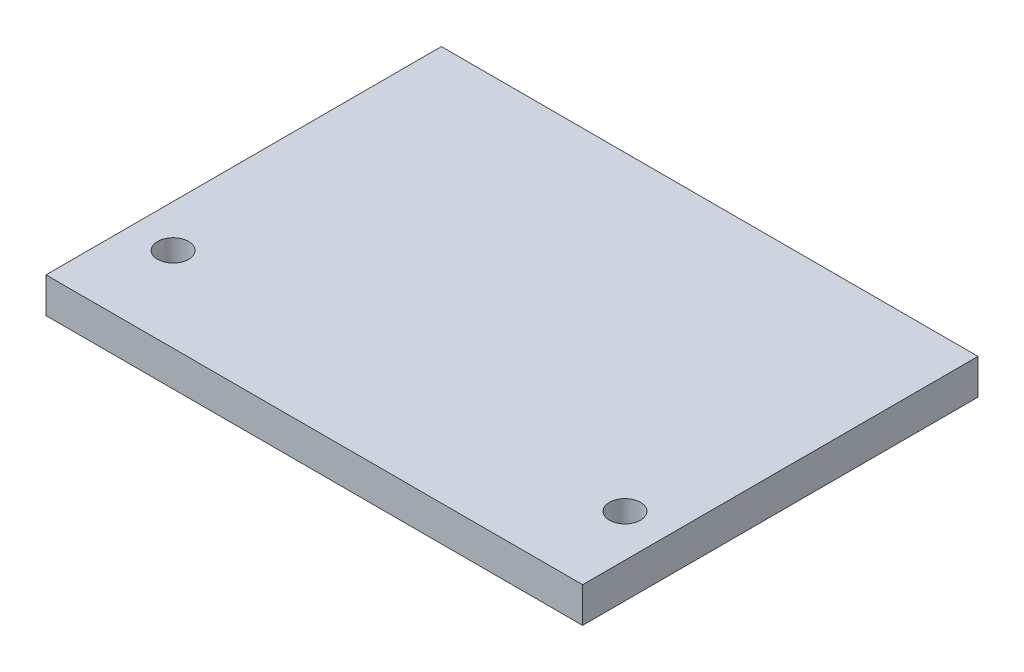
ISO-10303-21;
HEADER;
FILE_DESCRIPTION(('STEP AP214'),'2;1');
FILE_NAME('part.step','',(''),(''),'','','');
FILE_SCHEMA(('AUTOMOTIVE_DESIGN { 1 0 10303 214 1 1 1 1 }'));
ENDSEC;
DATA;
#1=APPLICATION_CONTEXT('core data for automotive mechanical design processes');
#2=APPLICATION_PROTOCOL_DEFINITION('international standard','automotive_design',2000,#1);
#3=PRODUCT_CONTEXT('',#1,'mechanical');
#4=PRODUCT('Part','Part','',(#3));
#5=PRODUCT_RELATED_PRODUCT_CATEGORY('part','',(#4));
#6=PRODUCT_DEFINITION_FORMATION('','',#4);
#7=PRODUCT_DEFINITION_CONTEXT('part definition',#1,'design');
#8=PRODUCT_DEFINITION('design','',#6,#7);
#9=PRODUCT_DEFINITION_SHAPE('','',#8);
#10=(LENGTH_UNIT() NAMED_UNIT(*) SI_UNIT(.MILLI.,.METRE.));
#11=(NAMED_UNIT(*) PLANE_ANGLE_UNIT() SI_UNIT($,.RADIAN.));
#12=(NAMED_UNIT(*) SI_UNIT($,.STERADIAN.) SOLID_ANGLE_UNIT());
#13=UNCERTAINTY_MEASURE_WITH_UNIT(LENGTH_MEASURE(1.E-05),#10,'distance_accuracy_value','');
#14=(GEOMETRIC_REPRESENTATION_CONTEXT(3) GLOBAL_UNCERTAINTY_ASSIGNED_CONTEXT((#13)) GLOBAL_UNIT_ASSIGNED_CONTEXT((#10,
#11,#12)) REPRESENTATION_CONTEXT('',''));
#15=CARTESIAN_POINT('',(0.,0.,0.));
#16=DIRECTION('',(0.,0.,1.));
#17=DIRECTION('',(1.,0.,0.));
#18=AXIS2_PLACEMENT_3D('',#15,#16,#17);
#19=CARTESIAN_POINT('',(0.,2.5,0.));
#20=DIRECTION('',(0.,-1.,0.));
#21=DIRECTION('',(0.,0.,-1.));
#22=AXIS2_PLACEMENT_3D('',#19,#20,#21);
#23=PLANE('',#22);
#24=CARTESIAN_POINT('',(35.,2.5,-6.));
#25=DIRECTION('',(0.,1.,0.));
#26=DIRECTION('',(0.,0.,1.));
#27=AXIS2_PLACEMENT_3D('',#24,#25,#26);
#28=CIRCLE('',#27,1.1);
#29=CARTESIAN_POINT('',(35.,2.5,-4.9));
#30=VERTEX_POINT('',#29);
#31=EDGE_CURVE('E85',#30,#30,#28,.T.);
#32=ORIENTED_EDGE('',*,*,#31,.F.);
#33=EDGE_LOOP('',(#32));
#34=FACE_BOUND('',#33,.T.);
#35=DIRECTION('',(0.,0.,1.));
#36=VECTOR('',#35,1.);
#37=CARTESIAN_POINT('',(0.,2.5,0.));
#38=LINE('',#37,#36);
#39=CARTESIAN_POINT('',(0.,2.5,-28.));
#40=VERTEX_POINT('',#39);
#41=CARTESIAN_POINT('',(0.,2.5,0.));
#42=VERTEX_POINT('',#41);
#43=EDGE_CURVE('E95',#40,#42,#38,.T.);
#44=ORIENTED_EDGE('',*,*,#43,.T.);
#45=DIRECTION('',(1.,0.,0.));
#46=VECTOR('',#45,1.);
#47=CARTESIAN_POINT('',(0.,2.5,0.));
#48=LINE('',#47,#46);
#49=CARTESIAN_POINT('',(38.,2.5,0.));
#50=VERTEX_POINT('',#49);
#51=EDGE_CURVE('E80',#42,#50,#48,.T.);
#52=ORIENTED_EDGE('',*,*,#51,.T.);
#53=DIRECTION('',(0.,0.,-1.));
#54=VECTOR('',#53,1.);
#55=CARTESIAN_POINT('',(38.,2.5,0.));
#56=LINE('',#55,#54);
#57=CARTESIAN_POINT('',(38.,2.5,-28.));
#58=VERTEX_POINT('',#57);
#59=EDGE_CURVE('E46',#50,#58,#56,.T.);
#60=ORIENTED_EDGE('',*,*,#59,.T.);
#61=DIRECTION('',(-1.,0.,0.));
#62=VECTOR('',#61,1.);
#63=CARTESIAN_POINT('',(0.,2.5,-28.));
#64=LINE('',#63,#62);
#65=EDGE_CURVE('E41',#58,#40,#64,.T.);
#66=ORIENTED_EDGE('',*,*,#65,.T.);
#67=EDGE_LOOP('',(#44,#52,#60,#66));
#68=FACE_BOUND('',#67,.T.);
#69=CARTESIAN_POINT('',(3.,2.5,-6.));
#70=DIRECTION('',(0.,1.,0.));
#71=DIRECTION('',(0.,0.,-1.));
#72=AXIS2_PLACEMENT_3D('',#69,#70,#71);
#73=CIRCLE('',#72,1.1);
#74=CARTESIAN_POINT('',(3.,2.5,-7.1));
#75=VERTEX_POINT('',#74);
#76=EDGE_CURVE('E113',#75,#75,#73,.T.);
#77=ORIENTED_EDGE('',*,*,#76,.F.);
#78=EDGE_LOOP('',(#77));
#79=FACE_BOUND('',#78,.T.);
#80=ADVANCED_FACE('F26',(#34,#68,#79),#23,.F.);
#81=CARTESIAN_POINT('',(0.,0.,0.));
#82=DIRECTION('',(0.,-1.,0.));
#83=DIRECTION('',(0.,0.,-1.));
#84=AXIS2_PLACEMENT_3D('',#81,#82,#83);
#85=PLANE('',#84);
#86=CARTESIAN_POINT('',(35.,0.,-6.));
#87=DIRECTION('',(0.,1.,0.));
#88=DIRECTION('',(0.,0.,1.));
#89=AXIS2_PLACEMENT_3D('',#86,#87,#88);
#90=CIRCLE('',#89,1.1);
#91=CARTESIAN_POINT('',(35.,0.,-4.9));
#92=VERTEX_POINT('',#91);
#93=EDGE_CURVE('E88',#92,#92,#90,.T.);
#94=ORIENTED_EDGE('',*,*,#93,.T.);
#95=EDGE_LOOP('',(#94));
#96=FACE_BOUND('',#95,.T.);
#97=DIRECTION('',(0.,0.,1.));
#98=VECTOR('',#97,1.);
#99=CARTESIAN_POINT('',(0.,0.,0.));
#100=LINE('',#99,#98);
#101=CARTESIAN_POINT('',(0.,0.,-28.));
#102=VERTEX_POINT('',#101);
#103=CARTESIAN_POINT('',(0.,0.,0.));
#104=VERTEX_POINT('',#103);
#105=EDGE_CURVE('E72',#102,#104,#100,.T.);
#106=ORIENTED_EDGE('',*,*,#105,.F.);
#107=DIRECTION('',(-1.,0.,0.));
#108=VECTOR('',#107,1.);
#109=CARTESIAN_POINT('',(0.,0.,-28.));
#110=LINE('',#109,#108);
#111=CARTESIAN_POINT('',(38.,0.,-28.));
#112=VERTEX_POINT('',#111);
#113=EDGE_CURVE('E93',#112,#102,#110,.T.);
#114=ORIENTED_EDGE('',*,*,#113,.F.);
#115=DIRECTION('',(0.,0.,-1.));
#116=VECTOR('',#115,1.);
#117=CARTESIAN_POINT('',(38.,0.,0.));
#118=LINE('',#117,#116);
#119=CARTESIAN_POINT('',(38.,0.,0.));
#120=VERTEX_POINT('',#119);
#121=EDGE_CURVE('E73',#120,#112,#118,.T.);
#122=ORIENTED_EDGE('',*,*,#121,.F.);
#123=DIRECTION('',(1.,0.,0.));
#124=VECTOR('',#123,1.);
#125=CARTESIAN_POINT('',(0.,0.,0.));
#126=LINE('',#125,#124);
#127=EDGE_CURVE('E67',#104,#120,#126,.T.);
#128=ORIENTED_EDGE('',*,*,#127,.F.);
#129=EDGE_LOOP('',(#106,#114,#122,#128));
#130=FACE_BOUND('',#129,.T.);
#131=CARTESIAN_POINT('',(3.,0.,-6.));
#132=DIRECTION('',(0.,1.,0.));
#133=DIRECTION('',(0.,0.,-1.));
#134=AXIS2_PLACEMENT_3D('',#131,#132,#133);
#135=CIRCLE('',#134,1.1);
#136=CARTESIAN_POINT('',(3.,0.,-7.1));
#137=VERTEX_POINT('',#136);
#138=EDGE_CURVE('E115',#137,#137,#135,.T.);
#139=ORIENTED_EDGE('',*,*,#138,.T.);
#140=EDGE_LOOP('',(#139));
#141=FACE_BOUND('',#140,.T.);
#142=ADVANCED_FACE('F68',(#96,#130,#141),#85,.T.);
#143=CARTESIAN_POINT('',(0.,2.5,0.));
#144=DIRECTION('',(1.,0.,0.));
#145=DIRECTION('',(0.,0.,-1.));
#146=AXIS2_PLACEMENT_3D('',#143,#144,#145);
#147=PLANE('',#146);
#148=ORIENTED_EDGE('',*,*,#105,.T.);
#149=DIRECTION('',(0.,-1.,0.));
#150=VECTOR('',#149,1.);
#151=CARTESIAN_POINT('',(0.,2.5,0.));
#152=LINE('',#151,#150);
#153=EDGE_CURVE('E11',#42,#104,#152,.T.);
#154=ORIENTED_EDGE('',*,*,#153,.F.);
#155=ORIENTED_EDGE('',*,*,#43,.F.);
#156=DIRECTION('',(0.,-1.,0.));
#157=VECTOR('',#156,1.);
#158=CARTESIAN_POINT('',(0.,2.5,-28.));
#159=LINE('',#158,#157);
#160=EDGE_CURVE('E84',#40,#102,#159,.T.);
#161=ORIENTED_EDGE('',*,*,#160,.T.);
#162=EDGE_LOOP('',(#148,#154,#155,#161));
#163=FACE_BOUND('',#162,.T.);
#164=ADVANCED_FACE('F28',(#163),#147,.F.);
#165=CARTESIAN_POINT('',(0.,2.5,0.));
#166=DIRECTION('',(0.,0.,-1.));
#167=DIRECTION('',(-1.,0.,0.));
#168=AXIS2_PLACEMENT_3D('',#165,#166,#167);
#169=PLANE('',#168);
#170=ORIENTED_EDGE('',*,*,#127,.T.);
#171=DIRECTION('',(0.,-1.,0.));
#172=VECTOR('',#171,1.);
#173=CARTESIAN_POINT('',(38.,2.5,0.));
#174=LINE('',#173,#172);
#175=EDGE_CURVE('E34',#50,#120,#174,.T.);
#176=ORIENTED_EDGE('',*,*,#175,.F.);
#177=ORIENTED_EDGE('',*,*,#51,.F.);
#178=ORIENTED_EDGE('',*,*,#153,.T.);
#179=EDGE_LOOP('',(#170,#176,#177,#178));
#180=FACE_BOUND('',#179,.T.);
#181=ADVANCED_FACE('F79',(#180),#169,.F.);
#182=CARTESIAN_POINT('',(38.,2.5,0.));
#183=DIRECTION('',(-1.,0.,0.));
#184=DIRECTION('',(0.,0.,1.));
#185=AXIS2_PLACEMENT_3D('',#182,#183,#184);
#186=PLANE('',#185);
#187=ORIENTED_EDGE('',*,*,#121,.T.);
#188=DIRECTION('',(0.,-1.,0.));
#189=VECTOR('',#188,1.);
#190=CARTESIAN_POINT('',(38.,2.5,-28.));
#191=LINE('',#190,#189);
#192=EDGE_CURVE('E101',#58,#112,#191,.T.);
#193=ORIENTED_EDGE('',*,*,#192,.F.);
#194=ORIENTED_EDGE('',*,*,#59,.F.);
#195=ORIENTED_EDGE('',*,*,#175,.T.);
#196=EDGE_LOOP('',(#187,#193,#194,#195));
#197=FACE_BOUND('',#196,.T.);
#198=ADVANCED_FACE('F104',(#197),#186,.F.);
#199=CARTESIAN_POINT('',(0.,2.5,-28.));
#200=DIRECTION('',(0.,0.,1.));
#201=DIRECTION('',(1.,0.,0.));
#202=AXIS2_PLACEMENT_3D('',#199,#200,#201);
#203=PLANE('',#202);
#204=ORIENTED_EDGE('',*,*,#113,.T.);
#205=ORIENTED_EDGE('',*,*,#160,.F.);
#206=ORIENTED_EDGE('',*,*,#65,.F.);
#207=ORIENTED_EDGE('',*,*,#192,.T.);
#208=EDGE_LOOP('',(#204,#205,#206,#207));
#209=FACE_BOUND('',#208,.T.);
#210=ADVANCED_FACE('F106',(#209),#203,.F.);
#211=CARTESIAN_POINT('',(35.,2.5,-6.));
#212=DIRECTION('',(0.,-1.,0.));
#213=DIRECTION('',(0.,0.,-1.));
#214=AXIS2_PLACEMENT_3D('',#211,#212,#213);
#215=CYLINDRICAL_SURFACE('',#214,1.1);
#216=ORIENTED_EDGE('',*,*,#31,.T.);
#217=EDGE_LOOP('',(#216));
#218=FACE_BOUND('',#217,.T.);
#219=ORIENTED_EDGE('',*,*,#93,.F.);
#220=EDGE_LOOP('',(#219));
#221=FACE_BOUND('',#220,.T.);
#222=ADVANCED_FACE('F124',(#218,#221),#215,.F.);
#223=CARTESIAN_POINT('',(3.,2.5,-6.));
#224=DIRECTION('',(0.,-1.,0.));
#225=DIRECTION('',(0.,0.,-1.));
#226=AXIS2_PLACEMENT_3D('',#223,#224,#225);
#227=CYLINDRICAL_SURFACE('',#226,1.1);
#228=ORIENTED_EDGE('',*,*,#76,.T.);
#229=EDGE_LOOP('',(#228));
#230=FACE_BOUND('',#229,.T.);
#231=ORIENTED_EDGE('',*,*,#138,.F.);
#232=EDGE_LOOP('',(#231));
#233=FACE_BOUND('',#232,.T.);
#234=ADVANCED_FACE('F122',(#230,#233),#227,.F.);
#235=CLOSED_SHELL('',(#80,#142,#164,#181,#198,#210,#222,#234));
#236=MANIFOLD_SOLID_BREP('B2',#235);
#237=ADVANCED_BREP_SHAPE_REPRESENTATION('',(#18,#236),#14);
#238=SHAPE_DEFINITION_REPRESENTATION(#9,#237);
ENDSEC;
END-ISO-10303-21;
